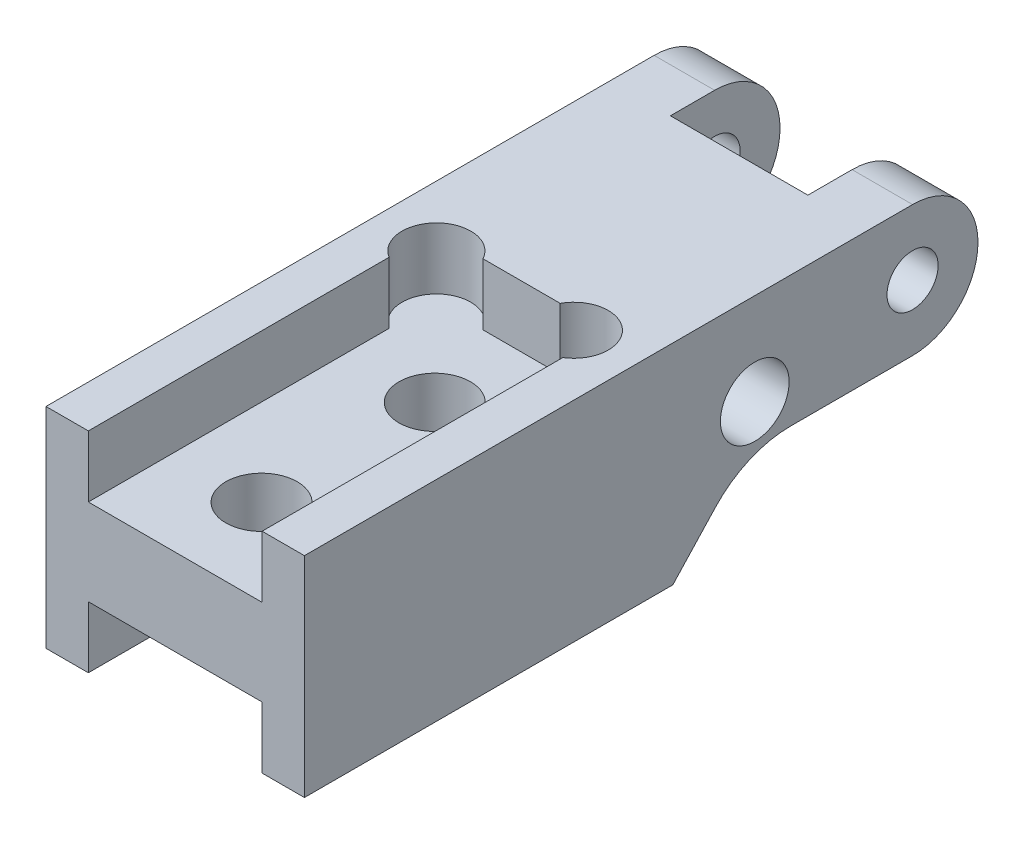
ISO-10303-21;
HEADER;
FILE_DESCRIPTION(('STEP AP214'),'2;1');
FILE_NAME('part.step','',(''),(''),'','','');
FILE_SCHEMA(('AUTOMOTIVE_DESIGN { 1 0 10303 214 1 1 1 1 }'));
ENDSEC;
DATA;
#1=APPLICATION_CONTEXT('core data for automotive mechanical design processes');
#2=APPLICATION_PROTOCOL_DEFINITION('international standard','automotive_design',2000,#1);
#3=PRODUCT_CONTEXT('',#1,'mechanical');
#4=PRODUCT('Part','Part','',(#3));
#5=PRODUCT_RELATED_PRODUCT_CATEGORY('part','',(#4));
#6=PRODUCT_DEFINITION_FORMATION('','',#4);
#7=PRODUCT_DEFINITION_CONTEXT('part definition',#1,'design');
#8=PRODUCT_DEFINITION('design','',#6,#7);
#9=PRODUCT_DEFINITION_SHAPE('','',#8);
#10=(LENGTH_UNIT() NAMED_UNIT(*) SI_UNIT(.MILLI.,.METRE.));
#11=(NAMED_UNIT(*) PLANE_ANGLE_UNIT() SI_UNIT($,.RADIAN.));
#12=(NAMED_UNIT(*) SI_UNIT($,.STERADIAN.) SOLID_ANGLE_UNIT());
#13=UNCERTAINTY_MEASURE_WITH_UNIT(LENGTH_MEASURE(1.E-05),#10,'distance_accuracy_value','');
#14=(GEOMETRIC_REPRESENTATION_CONTEXT(3) GLOBAL_UNCERTAINTY_ASSIGNED_CONTEXT((#13)) GLOBAL_UNIT_ASSIGNED_CONTEXT((#10,
#11,#12)) REPRESENTATION_CONTEXT('',''));
#15=CARTESIAN_POINT('',(0.,0.,0.));
#16=DIRECTION('',(0.,0.,1.));
#17=DIRECTION('',(1.,0.,0.));
#18=AXIS2_PLACEMENT_3D('',#15,#16,#17);
#19=CARTESIAN_POINT('',(-5.96899999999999,4.8387,-15.5575));
#20=DIRECTION('',(0.,1.,0.));
#21=DIRECTION('',(0.,0.,1.));
#22=AXIS2_PLACEMENT_3D('',#19,#20,#21);
#23=PLANE('',#22);
#24=CARTESIAN_POINT('',(-3.175,4.8387,0.317500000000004));
#25=DIRECTION('',(0.,1.,0.));
#26=DIRECTION('',(0.,0.,-1.));
#27=AXIS2_PLACEMENT_3D('',#24,#25,#26);
#28=CIRCLE('',#27,1.5875);
#29=CARTESIAN_POINT('',(-1.78233627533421,4.8387,-0.444499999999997));
#30=VERTEX_POINT('',#29);
#31=CARTESIAN_POINT('',(-4.0132,4.8387,1.66567543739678));
#32=VERTEX_POINT('',#31);
#33=EDGE_CURVE('E462',#30,#32,#28,.T.);
#34=ORIENTED_EDGE('',*,*,#33,.F.);
#35=DIRECTION('',(-1.,0.,0.));
#36=VECTOR('',#35,1.);
#37=CARTESIAN_POINT('',(4.0132,4.8387,-0.444499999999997));
#38=LINE('',#37,#36);
#39=CARTESIAN_POINT('',(1.78233627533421,4.8387,-0.444499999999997));
#40=VERTEX_POINT('',#39);
#41=EDGE_CURVE('E413',#40,#30,#38,.T.);
#42=ORIENTED_EDGE('',*,*,#41,.F.);
#43=CARTESIAN_POINT('',(3.175,4.8387,0.317500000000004));
#44=DIRECTION('',(0.,1.,0.));
#45=DIRECTION('',(0.,0.,1.));
#46=AXIS2_PLACEMENT_3D('',#43,#44,#45);
#47=CIRCLE('',#46,1.5875);
#48=CARTESIAN_POINT('',(4.0132,4.8387,1.66567543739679));
#49=VERTEX_POINT('',#48);
#50=EDGE_CURVE('E410',#49,#40,#47,.T.);
#51=ORIENTED_EDGE('',*,*,#50,.F.);
#52=DIRECTION('',(0.,0.,-1.));
#53=VECTOR('',#52,1.);
#54=CARTESIAN_POINT('',(4.0132,4.8387,15.5575));
#55=LINE('',#54,#53);
#56=CARTESIAN_POINT('',(4.0132,4.8387,15.5575));
#57=VERTEX_POINT('',#56);
#58=EDGE_CURVE('E408',#57,#49,#55,.T.);
#59=ORIENTED_EDGE('',*,*,#58,.F.);
#60=DIRECTION('',(1.,0.,0.));
#61=VECTOR('',#60,1.);
#62=CARTESIAN_POINT('',(-5.969,4.8387,15.5575));
#63=LINE('',#62,#61);
#64=CARTESIAN_POINT('',(5.969,4.8387,15.5575));
#65=VERTEX_POINT('',#64);
#66=EDGE_CURVE('E320',#57,#65,#63,.T.);
#67=ORIENTED_EDGE('',*,*,#66,.T.);
#68=DIRECTION('',(0.,0.,-1.));
#69=VECTOR('',#68,1.);
#70=CARTESIAN_POINT('',(5.969,4.8387,-15.5575));
#71=LINE('',#70,#69);
#72=CARTESIAN_POINT('',(5.969,4.8387,-12.5349));
#73=VERTEX_POINT('',#72);
#74=EDGE_CURVE('E325',#65,#73,#71,.T.);
#75=ORIENTED_EDGE('',*,*,#74,.T.);
#76=DIRECTION('',(-1.,0.,0.));
#77=VECTOR('',#76,1.);
#78=CARTESIAN_POINT('',(-5.96899999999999,4.8387,-12.5349));
#79=LINE('',#78,#77);
#80=CARTESIAN_POINT('',(3.175,4.8387,-12.5349));
#81=VERTEX_POINT('',#80);
#82=EDGE_CURVE('E341',#73,#81,#79,.T.);
#83=ORIENTED_EDGE('',*,*,#82,.T.);
#84=DIRECTION('',(0.,0.,-1.));
#85=VECTOR('',#84,1.);
#86=CARTESIAN_POINT('',(3.175,4.8387,-15.5575));
#87=LINE('',#86,#85);
#88=CARTESIAN_POINT('',(3.175,4.8387,-10.4927289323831));
#89=VERTEX_POINT('',#88);
#90=EDGE_CURVE('E249',#89,#81,#87,.T.);
#91=ORIENTED_EDGE('',*,*,#90,.F.);
#92=DIRECTION('',(1.,0.,0.));
#93=VECTOR('',#92,1.);
#94=CARTESIAN_POINT('',(-5.96899999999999,4.8387,-10.4927289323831));
#95=LINE('',#94,#93);
#96=CARTESIAN_POINT('',(-3.175,4.8387,-10.4927289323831));
#97=VERTEX_POINT('',#96);
#98=EDGE_CURVE('E265',#97,#89,#95,.T.);
#99=ORIENTED_EDGE('',*,*,#98,.F.);
#100=DIRECTION('',(0.,0.,-1.));
#101=VECTOR('',#100,1.);
#102=CARTESIAN_POINT('',(-3.175,4.8387,-15.5575));
#103=LINE('',#102,#101);
#104=CARTESIAN_POINT('',(-3.175,4.8387,-12.5349));
#105=VERTEX_POINT('',#104);
#106=EDGE_CURVE('E260',#97,#105,#103,.T.);
#107=ORIENTED_EDGE('',*,*,#106,.T.);
#108=CARTESIAN_POINT('',(-5.96899999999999,4.8387,-12.5349));
#109=VERTEX_POINT('',#108);
#110=EDGE_CURVE('E340',#105,#109,#79,.T.);
#111=ORIENTED_EDGE('',*,*,#110,.T.);
#112=DIRECTION('',(0.,0.,1.));
#113=VECTOR('',#112,1.);
#114=CARTESIAN_POINT('',(-5.96899999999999,4.8387,-15.5575));
#115=LINE('',#114,#113);
#116=CARTESIAN_POINT('',(-5.969,4.8387,15.5575));
#117=VERTEX_POINT('',#116);
#118=EDGE_CURVE('E318',#109,#117,#115,.T.);
#119=ORIENTED_EDGE('',*,*,#118,.T.);
#120=CARTESIAN_POINT('',(-4.0132,4.8387,15.5575));
#121=VERTEX_POINT('',#120);
#122=EDGE_CURVE('E322',#117,#121,#63,.T.);
#123=ORIENTED_EDGE('',*,*,#122,.T.);
#124=DIRECTION('',(0.,0.,1.));
#125=VECTOR('',#124,1.);
#126=CARTESIAN_POINT('',(-4.0132,4.8387,15.5575));
#127=LINE('',#126,#125);
#128=EDGE_CURVE('E417',#32,#121,#127,.T.);
#129=ORIENTED_EDGE('',*,*,#128,.F.);
#130=EDGE_LOOP('',(#34,#42,#51,#59,#67,#75,#83,#91,#99,#107,#111,#119,#123,#129));
#131=FACE_BOUND('',#130,.T.);
#132=ADVANCED_FACE('F35',(#131),#23,.T.);
#133=CARTESIAN_POINT('',(-5.969,1.8161,-12.5349));
#134=DIRECTION('',(1.,0.,0.));
#135=DIRECTION('',(0.,0.,-1.));
#136=AXIS2_PLACEMENT_3D('',#133,#134,#135);
#137=CYLINDRICAL_SURFACE('',#136,3.0226);
#138=CARTESIAN_POINT('',(-3.175,1.8161,-12.5349));
#139=DIRECTION('',(1.,0.,0.));
#140=DIRECTION('',(0.,0.,-1.));
#141=AXIS2_PLACEMENT_3D('',#138,#139,#140);
#142=CIRCLE('',#141,3.0226);
#143=CARTESIAN_POINT('',(-3.175,-1.20650000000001,-12.5349));
#144=VERTEX_POINT('',#143);
#145=CARTESIAN_POINT('',(-3.175,1.8161,-15.5575));
#146=VERTEX_POINT('',#145);
#147=EDGE_CURVE('E258',#144,#146,#142,.T.);
#148=ORIENTED_EDGE('',*,*,#147,.F.);
#149=DIRECTION('',(1.,0.,0.));
#150=VECTOR('',#149,1.);
#151=CARTESIAN_POINT('',(-5.969,-1.20650000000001,-12.5349));
#152=LINE('',#151,#150);
#153=CARTESIAN_POINT('',(-5.969,-1.20650000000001,-12.5349));
#154=VERTEX_POINT('',#153);
#155=EDGE_CURVE('E315',#154,#144,#152,.T.);
#156=ORIENTED_EDGE('',*,*,#155,.F.);
#157=CARTESIAN_POINT('',(-5.969,1.8161,-12.5349));
#158=DIRECTION('',(-1.,0.,0.));
#159=DIRECTION('',(0.,0.,-1.));
#160=AXIS2_PLACEMENT_3D('',#157,#158,#159);
#161=CIRCLE('',#160,3.0226);
#162=CARTESIAN_POINT('',(-5.969,1.8161,-15.5575));
#163=VERTEX_POINT('',#162);
#164=EDGE_CURVE('E280',#163,#154,#161,.T.);
#165=ORIENTED_EDGE('',*,*,#164,.F.);
#166=DIRECTION('',(1.,0.,0.));
#167=VECTOR('',#166,1.);
#168=CARTESIAN_POINT('',(-5.969,1.8161,-15.5575));
#169=LINE('',#168,#167);
#170=EDGE_CURVE('E303',#163,#146,#169,.T.);
#171=ORIENTED_EDGE('',*,*,#170,.T.);
#172=EDGE_LOOP('',(#148,#156,#165,#171));
#173=FACE_BOUND('',#172,.T.);
#174=ADVANCED_FACE('F377',(#173),#137,.T.);
#175=CARTESIAN_POINT('',(-5.969,-1.20650000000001,-12.5349));
#176=DIRECTION('',(0.,1.,0.));
#177=DIRECTION('',(0.,0.,1.));
#178=AXIS2_PLACEMENT_3D('',#175,#176,#177);
#179=PLANE('',#178);
#180=DIRECTION('',(0.,0.,-1.));
#181=VECTOR('',#180,1.);
#182=CARTESIAN_POINT('',(-3.175,-1.20650000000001,-12.5349));
#183=LINE('',#182,#181);
#184=CARTESIAN_POINT('',(-3.175,-1.20650000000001,-7.00253108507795));
#185=VERTEX_POINT('',#184);
#186=EDGE_CURVE('E263',#185,#144,#183,.T.);
#187=ORIENTED_EDGE('',*,*,#186,.F.);
#188=DIRECTION('',(1.,0.,0.));
#189=VECTOR('',#188,1.);
#190=CARTESIAN_POINT('',(-5.969,-1.20650000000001,-7.00253108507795));
#191=LINE('',#190,#189);
#192=CARTESIAN_POINT('',(3.175,-1.20650000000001,-7.00253108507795));
#193=VERTEX_POINT('',#192);
#194=EDGE_CURVE('E11',#185,#193,#191,.T.);
#195=ORIENTED_EDGE('',*,*,#194,.T.);
#196=DIRECTION('',(0.,0.,-1.));
#197=VECTOR('',#196,1.);
#198=CARTESIAN_POINT('',(3.175,-1.20650000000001,-12.5349));
#199=LINE('',#198,#197);
#200=CARTESIAN_POINT('',(3.175,-1.20650000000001,-12.5349));
#201=VERTEX_POINT('',#200);
#202=EDGE_CURVE('E251',#193,#201,#199,.T.);
#203=ORIENTED_EDGE('',*,*,#202,.T.);
#204=CARTESIAN_POINT('',(5.969,-1.20650000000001,-12.5349));
#205=VERTEX_POINT('',#204);
#206=EDGE_CURVE('E293',#201,#205,#152,.T.);
#207=ORIENTED_EDGE('',*,*,#206,.T.);
#208=DIRECTION('',(0.,0.,1.));
#209=VECTOR('',#208,1.);
#210=CARTESIAN_POINT('',(5.969,-1.20650000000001,-12.5349));
#211=LINE('',#210,#209);
#212=CARTESIAN_POINT('',(5.969,-1.20650000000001,-6.90952915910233));
#213=VERTEX_POINT('',#212);
#214=EDGE_CURVE('E296',#205,#213,#211,.T.);
#215=ORIENTED_EDGE('',*,*,#214,.T.);
#216=DIRECTION('',(1.,0.,0.));
#217=VECTOR('',#216,1.);
#218=CARTESIAN_POINT('',(-5.969,-1.20650000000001,-6.90952915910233));
#219=LINE('',#218,#217);
#220=CARTESIAN_POINT('',(-5.969,-1.20650000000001,-6.90952915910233));
#221=VERTEX_POINT('',#220);
#222=EDGE_CURVE('E313',#221,#213,#219,.T.);
#223=ORIENTED_EDGE('',*,*,#222,.F.);
#224=DIRECTION('',(0.,0.,1.));
#225=VECTOR('',#224,1.);
#226=CARTESIAN_POINT('',(-5.969,-1.20650000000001,-12.5349));
#227=LINE('',#226,#225);
#228=EDGE_CURVE('E283',#154,#221,#227,.T.);
#229=ORIENTED_EDGE('',*,*,#228,.F.);
#230=ORIENTED_EDGE('',*,*,#155,.T.);
#231=EDGE_LOOP('',(#187,#195,#203,#207,#215,#223,#229,#230));
#232=FACE_BOUND('',#231,.T.);
#233=ADVANCED_FACE('F368',(#232),#179,.F.);
#234=CARTESIAN_POINT('',(-5.96899999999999,1.8161,-12.5349));
#235=DIRECTION('',(1.,0.,0.));
#236=DIRECTION('',(0.,0.,-1.));
#237=AXIS2_PLACEMENT_3D('',#234,#235,#236);
#238=CYLINDRICAL_SURFACE('',#237,3.0226);
#239=ORIENTED_EDGE('',*,*,#110,.F.);
#240=CARTESIAN_POINT('',(-3.175,1.8161,-12.5349));
#241=DIRECTION('',(1.,0.,0.));
#242=DIRECTION('',(0.,0.,-1.));
#243=AXIS2_PLACEMENT_3D('',#240,#241,#242);
#244=CIRCLE('',#243,3.0226);
#245=EDGE_CURVE('E255',#105,#146,#244,.F.);
#246=ORIENTED_EDGE('',*,*,#245,.T.);
#247=ORIENTED_EDGE('',*,*,#170,.F.);
#248=CARTESIAN_POINT('',(-5.96899999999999,1.8161,-12.5349));
#249=DIRECTION('',(1.,0.,0.));
#250=DIRECTION('',(0.,0.,-1.));
#251=AXIS2_PLACEMENT_3D('',#248,#249,#250);
#252=CIRCLE('',#251,3.0226);
#253=EDGE_CURVE('E344',#109,#163,#252,.F.);
#254=ORIENTED_EDGE('',*,*,#253,.F.);
#255=EDGE_LOOP('',(#239,#246,#247,#254));
#256=FACE_BOUND('',#255,.T.);
#257=ADVANCED_FACE('F358',(#256),#238,.T.);
#258=CARTESIAN_POINT('',(-5.969,1.8161,-12.5349));
#259=DIRECTION('',(1.,0.,0.));
#260=DIRECTION('',(0.,0.,-1.));
#261=AXIS2_PLACEMENT_3D('',#258,#259,#260);
#262=CYLINDRICAL_SURFACE('',#261,1.1811);
#263=CARTESIAN_POINT('',(-5.969,1.8161,-12.5349));
#264=DIRECTION('',(1.,0.,0.));
#265=DIRECTION('',(0.,0.,-1.));
#266=AXIS2_PLACEMENT_3D('',#263,#264,#265);
#267=CIRCLE('',#266,1.1811);
#268=CARTESIAN_POINT('',(-5.969,1.8161,-13.716));
#269=VERTEX_POINT('',#268);
#270=EDGE_CURVE('E274',#269,#269,#267,.T.);
#271=ORIENTED_EDGE('',*,*,#270,.F.);
#272=EDGE_LOOP('',(#271));
#273=FACE_BOUND('',#272,.T.);
#274=CARTESIAN_POINT('',(-3.175,1.8161,-12.5349));
#275=DIRECTION('',(1.,0.,0.));
#276=DIRECTION('',(0.,0.,-1.));
#277=AXIS2_PLACEMENT_3D('',#274,#275,#276);
#278=CIRCLE('',#277,1.1811);
#279=CARTESIAN_POINT('',(-3.175,1.8161,-13.716));
#280=VERTEX_POINT('',#279);
#281=EDGE_CURVE('E254',#280,#280,#278,.F.);
#282=ORIENTED_EDGE('',*,*,#281,.F.);
#283=EDGE_LOOP('',(#282));
#284=FACE_BOUND('',#283,.T.);
#285=ADVANCED_FACE('F355',(#273,#284),#262,.F.);
#286=CARTESIAN_POINT('',(-5.96899999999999,4.8387,-15.5575));
#287=DIRECTION('',(1.,0.,0.));
#288=DIRECTION('',(0.,0.,-1.));
#289=AXIS2_PLACEMENT_3D('',#286,#287,#288);
#290=PLANE('',#289);
#291=CARTESIAN_POINT('',(-5.96900000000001,0.596899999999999,-5.24509999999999));
#292=DIRECTION('',(1.,0.,0.));
#293=DIRECTION('',(0.,0.,-1.));
#294=AXIS2_PLACEMENT_3D('',#291,#292,#293);
#295=CIRCLE('',#294,1.5875);
#296=CARTESIAN_POINT('',(-5.96900000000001,0.596899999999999,-6.83259999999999));
#297=VERTEX_POINT('',#296);
#298=EDGE_CURVE('E268',#297,#297,#295,.T.);
#299=ORIENTED_EDGE('',*,*,#298,.T.);
#300=EDGE_LOOP('',(#299));
#301=FACE_BOUND('',#300,.T.);
#302=ORIENTED_EDGE('',*,*,#270,.T.);
#303=EDGE_LOOP('',(#302));
#304=FACE_BOUND('',#303,.T.);
#305=ORIENTED_EDGE('',*,*,#118,.F.);
#306=ORIENTED_EDGE('',*,*,#253,.T.);
#307=ORIENTED_EDGE('',*,*,#164,.T.);
#308=ORIENTED_EDGE('',*,*,#228,.T.);
#309=CARTESIAN_POINT('',(-5.969,-5.96900000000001,-6.90952915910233));
#310=DIRECTION('',(1.,0.,0.));
#311=DIRECTION('',(0.,0.,-1.));
#312=AXIS2_PLACEMENT_3D('',#309,#310,#311);
#313=CIRCLE('',#312,4.7625);
#314=CARTESIAN_POINT('',(-5.969,-2.72880380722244,-3.41918033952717));
#315=VERTEX_POINT('',#314);
#316=EDGE_CURVE('E287',#221,#315,#313,.T.);
#317=ORIENTED_EDGE('',*,*,#316,.T.);
#318=DIRECTION('',(0.,-0.732881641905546,0.680356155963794));
#319=VECTOR('',#318,1.);
#320=CARTESIAN_POINT('',(-5.969,-4.8387,-1.4605));
#321=LINE('',#320,#319);
#322=CARTESIAN_POINT('',(-5.969,-4.8387,-1.4605));
#323=VERTEX_POINT('',#322);
#324=EDGE_CURVE('E290',#315,#323,#321,.T.);
#325=ORIENTED_EDGE('',*,*,#324,.T.);
#326=DIRECTION('',(0.,0.,1.));
#327=VECTOR('',#326,1.);
#328=CARTESIAN_POINT('',(-5.96899999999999,-4.8387,-15.5575));
#329=LINE('',#328,#327);
#330=CARTESIAN_POINT('',(-5.969,-4.8387,15.5575));
#331=VERTEX_POINT('',#330);
#332=EDGE_CURVE('E306',#323,#331,#329,.T.);
#333=ORIENTED_EDGE('',*,*,#332,.T.);
#334=DIRECTION('',(0.,-1.,0.));
#335=VECTOR('',#334,1.);
#336=CARTESIAN_POINT('',(-5.969,4.8387,15.5575));
#337=LINE('',#336,#335);
#338=EDGE_CURVE('E337',#117,#331,#337,.T.);
#339=ORIENTED_EDGE('',*,*,#338,.F.);
#340=EDGE_LOOP('',(#305,#306,#307,#308,#317,#325,#333,#339));
#341=FACE_BOUND('',#340,.T.);
#342=ADVANCED_FACE('F357',(#301,#304,#341),#290,.F.);
#343=CARTESIAN_POINT('',(-5.969,4.8387,15.5575));
#344=DIRECTION('',(0.,0.,-1.));
#345=DIRECTION('',(-1.,0.,0.));
#346=AXIS2_PLACEMENT_3D('',#343,#344,#345);
#347=PLANE('',#346);
#348=ORIENTED_EDGE('',*,*,#66,.F.);
#349=DIRECTION('',(0.,1.,0.));
#350=VECTOR('',#349,1.);
#351=CARTESIAN_POINT('',(4.0132,1.9939,15.5575));
#352=LINE('',#351,#350);
#353=CARTESIAN_POINT('',(4.0132,1.9939,15.5575));
#354=VERTEX_POINT('',#353);
#355=EDGE_CURVE('E229',#354,#57,#352,.T.);
#356=ORIENTED_EDGE('',*,*,#355,.F.);
#357=DIRECTION('',(1.,0.,0.));
#358=VECTOR('',#357,1.);
#359=CARTESIAN_POINT('',(4.0132,1.9939,15.5575));
#360=LINE('',#359,#358);
#361=CARTESIAN_POINT('',(-4.0132,1.9939,15.5575));
#362=VERTEX_POINT('',#361);
#363=EDGE_CURVE('E422',#362,#354,#360,.T.);
#364=ORIENTED_EDGE('',*,*,#363,.F.);
#365=DIRECTION('',(0.,1.,0.));
#366=VECTOR('',#365,1.);
#367=CARTESIAN_POINT('',(-4.0132,1.9939,15.5575));
#368=LINE('',#367,#366);
#369=EDGE_CURVE('E428',#362,#121,#368,.T.);
#370=ORIENTED_EDGE('',*,*,#369,.T.);
#371=ORIENTED_EDGE('',*,*,#122,.F.);
#372=ORIENTED_EDGE('',*,*,#338,.T.);
#373=DIRECTION('',(1.,0.,0.));
#374=VECTOR('',#373,1.);
#375=CARTESIAN_POINT('',(-5.969,-4.8387,15.5575));
#376=LINE('',#375,#374);
#377=CARTESIAN_POINT('',(-4.0132,-4.8387,15.5575));
#378=VERTEX_POINT('',#377);
#379=EDGE_CURVE('E331',#331,#378,#376,.T.);
#380=ORIENTED_EDGE('',*,*,#379,.T.);
#381=DIRECTION('',(0.,-1.,0.));
#382=VECTOR('',#381,1.);
#383=CARTESIAN_POINT('',(-4.0132,-1.9939,15.5575));
#384=LINE('',#383,#382);
#385=CARTESIAN_POINT('',(-4.0132,-1.9939,15.5575));
#386=VERTEX_POINT('',#385);
#387=EDGE_CURVE('E224',#386,#378,#384,.T.);
#388=ORIENTED_EDGE('',*,*,#387,.F.);
#389=DIRECTION('',(-1.,0.,0.));
#390=VECTOR('',#389,1.);
#391=CARTESIAN_POINT('',(4.0132,-1.9939,15.5575));
#392=LINE('',#391,#390);
#393=CARTESIAN_POINT('',(4.0132,-1.9939,15.5575));
#394=VERTEX_POINT('',#393);
#395=EDGE_CURVE('E432',#394,#386,#392,.T.);
#396=ORIENTED_EDGE('',*,*,#395,.F.);
#397=DIRECTION('',(0.,-1.,0.));
#398=VECTOR('',#397,1.);
#399=CARTESIAN_POINT('',(4.0132,-1.9939,15.5575));
#400=LINE('',#399,#398);
#401=CARTESIAN_POINT('',(4.0132,-4.8387,15.5575));
#402=VERTEX_POINT('',#401);
#403=EDGE_CURVE('E235',#394,#402,#400,.T.);
#404=ORIENTED_EDGE('',*,*,#403,.T.);
#405=CARTESIAN_POINT('',(5.969,-4.8387,15.5575));
#406=VERTEX_POINT('',#405);
#407=EDGE_CURVE('E330',#402,#406,#376,.T.);
#408=ORIENTED_EDGE('',*,*,#407,.T.);
#409=DIRECTION('',(0.,-1.,0.));
#410=VECTOR('',#409,1.);
#411=CARTESIAN_POINT('',(5.969,4.8387,15.5575));
#412=LINE('',#411,#410);
#413=EDGE_CURVE('E328',#65,#406,#412,.T.);
#414=ORIENTED_EDGE('',*,*,#413,.F.);
#415=EDGE_LOOP('',(#348,#356,#364,#370,#371,#372,#380,#388,#396,#404,#408,#414));
#416=FACE_BOUND('',#415,.T.);
#417=ADVANCED_FACE('F366',(#416),#347,.F.);
#418=CARTESIAN_POINT('',(5.969,4.8387,-15.5575));
#419=DIRECTION('',(-1.,0.,0.));
#420=DIRECTION('',(0.,0.,1.));
#421=AXIS2_PLACEMENT_3D('',#418,#419,#420);
#422=PLANE('',#421);
#423=CARTESIAN_POINT('',(5.969,0.596899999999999,-5.24509999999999));
#424=DIRECTION('',(1.,0.,0.));
#425=DIRECTION('',(0.,0.,-1.));
#426=AXIS2_PLACEMENT_3D('',#423,#424,#425);
#427=CIRCLE('',#426,1.5875);
#428=CARTESIAN_POINT('',(5.969,0.596899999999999,-6.83259999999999));
#429=VERTEX_POINT('',#428);
#430=EDGE_CURVE('E267',#429,#429,#427,.T.);
#431=ORIENTED_EDGE('',*,*,#430,.F.);
#432=EDGE_LOOP('',(#431));
#433=FACE_BOUND('',#432,.T.);
#434=CARTESIAN_POINT('',(5.969,1.8161,-12.5349));
#435=DIRECTION('',(1.,0.,0.));
#436=DIRECTION('',(0.,0.,-1.));
#437=AXIS2_PLACEMENT_3D('',#434,#435,#436);
#438=CIRCLE('',#437,1.1811);
#439=CARTESIAN_POINT('',(5.969,1.8161,-13.716));
#440=VERTEX_POINT('',#439);
#441=EDGE_CURVE('E271',#440,#440,#438,.T.);
#442=ORIENTED_EDGE('',*,*,#441,.F.);
#443=EDGE_LOOP('',(#442));
#444=FACE_BOUND('',#443,.T.);
#445=CARTESIAN_POINT('',(5.969,1.8161,-12.5349));
#446=DIRECTION('',(-1.,0.,0.));
#447=DIRECTION('',(0.,0.,-1.));
#448=AXIS2_PLACEMENT_3D('',#445,#446,#447);
#449=CIRCLE('',#448,3.0226);
#450=CARTESIAN_POINT('',(5.969,1.8161,-15.5575));
#451=VERTEX_POINT('',#450);
#452=EDGE_CURVE('E277',#451,#205,#449,.T.);
#453=ORIENTED_EDGE('',*,*,#452,.F.);
#454=CARTESIAN_POINT('',(5.969,1.8161,-12.5349));
#455=DIRECTION('',(-1.,0.,0.));
#456=DIRECTION('',(0.,0.,1.));
#457=AXIS2_PLACEMENT_3D('',#454,#455,#456);
#458=CIRCLE('',#457,3.0226);
#459=EDGE_CURVE('E44',#451,#73,#458,.F.);
#460=ORIENTED_EDGE('',*,*,#459,.T.);
#461=ORIENTED_EDGE('',*,*,#74,.F.);
#462=ORIENTED_EDGE('',*,*,#413,.T.);
#463=DIRECTION('',(0.,0.,-1.));
#464=VECTOR('',#463,1.);
#465=CARTESIAN_POINT('',(5.969,-4.8387,-15.5575));
#466=LINE('',#465,#464);
#467=CARTESIAN_POINT('',(5.969,-4.8387,-1.4605));
#468=VERTEX_POINT('',#467);
#469=EDGE_CURVE('E321',#406,#468,#466,.T.);
#470=ORIENTED_EDGE('',*,*,#469,.T.);
#471=DIRECTION('',(0.,-0.732881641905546,0.680356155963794));
#472=VECTOR('',#471,1.);
#473=CARTESIAN_POINT('',(5.969,-4.8387,-1.4605));
#474=LINE('',#473,#472);
#475=CARTESIAN_POINT('',(5.969,-2.72880380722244,-3.41918033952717));
#476=VERTEX_POINT('',#475);
#477=EDGE_CURVE('E284',#476,#468,#474,.T.);
#478=ORIENTED_EDGE('',*,*,#477,.F.);
#479=CARTESIAN_POINT('',(5.969,-5.96900000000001,-6.90952915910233));
#480=DIRECTION('',(1.,0.,0.));
#481=DIRECTION('',(0.,0.,-1.));
#482=AXIS2_PLACEMENT_3D('',#479,#480,#481);
#483=CIRCLE('',#482,4.7625);
#484=EDGE_CURVE('E299',#213,#476,#483,.T.);
#485=ORIENTED_EDGE('',*,*,#484,.F.);
#486=ORIENTED_EDGE('',*,*,#214,.F.);
#487=EDGE_LOOP('',(#453,#460,#461,#462,#470,#478,#485,#486));
#488=FACE_BOUND('',#487,.T.);
#489=ADVANCED_FACE('F391',(#433,#444,#488),#422,.F.);
#490=CARTESIAN_POINT('',(-5.96899999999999,-4.8387,-15.5575));
#491=DIRECTION('',(0.,1.,0.));
#492=DIRECTION('',(0.,0.,1.));
#493=AXIS2_PLACEMENT_3D('',#490,#491,#492);
#494=PLANE('',#493);
#495=DIRECTION('',(1.,0.,0.));
#496=VECTOR('',#495,1.);
#497=CARTESIAN_POINT('',(4.0132,-4.8387,-0.444499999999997));
#498=LINE('',#497,#496);
#499=CARTESIAN_POINT('',(-1.78233627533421,-4.8387,-0.444499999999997));
#500=VERTEX_POINT('',#499);
#501=CARTESIAN_POINT('',(1.78233627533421,-4.8387,-0.444499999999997));
#502=VERTEX_POINT('',#501);
#503=EDGE_CURVE('E219',#500,#502,#498,.T.);
#504=ORIENTED_EDGE('',*,*,#503,.F.);
#505=CARTESIAN_POINT('',(-3.175,-4.8387,0.317500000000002));
#506=DIRECTION('',(0.,-1.,0.));
#507=DIRECTION('',(0.,0.,1.));
#508=AXIS2_PLACEMENT_3D('',#505,#506,#507);
#509=CIRCLE('',#508,1.5875);
#510=CARTESIAN_POINT('',(-4.0132,-4.8387,1.66567543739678));
#511=VERTEX_POINT('',#510);
#512=EDGE_CURVE('E204',#511,#500,#509,.T.);
#513=ORIENTED_EDGE('',*,*,#512,.F.);
#514=DIRECTION('',(0.,0.,-1.));
#515=VECTOR('',#514,1.);
#516=CARTESIAN_POINT('',(-4.0132,-4.8387,15.5575));
#517=LINE('',#516,#515);
#518=EDGE_CURVE('E216',#378,#511,#517,.T.);
#519=ORIENTED_EDGE('',*,*,#518,.F.);
#520=ORIENTED_EDGE('',*,*,#379,.F.);
#521=ORIENTED_EDGE('',*,*,#332,.F.);
#522=DIRECTION('',(1.,0.,0.));
#523=VECTOR('',#522,1.);
#524=CARTESIAN_POINT('',(-5.969,-4.8387,-1.4605));
#525=LINE('',#524,#523);
#526=EDGE_CURVE('E308',#323,#468,#525,.T.);
#527=ORIENTED_EDGE('',*,*,#526,.T.);
#528=ORIENTED_EDGE('',*,*,#469,.F.);
#529=ORIENTED_EDGE('',*,*,#407,.F.);
#530=DIRECTION('',(0.,0.,1.));
#531=VECTOR('',#530,1.);
#532=CARTESIAN_POINT('',(4.0132,-4.8387,15.5575));
#533=LINE('',#532,#531);
#534=CARTESIAN_POINT('',(4.0132,-4.8387,1.66567543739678));
#535=VERTEX_POINT('',#534);
#536=EDGE_CURVE('E225',#535,#402,#533,.T.);
#537=ORIENTED_EDGE('',*,*,#536,.F.);
#538=CARTESIAN_POINT('',(3.175,-4.8387,0.317500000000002));
#539=DIRECTION('',(0.,-1.,0.));
#540=DIRECTION('',(0.,0.,-1.));
#541=AXIS2_PLACEMENT_3D('',#538,#539,#540);
#542=CIRCLE('',#541,1.5875);
#543=EDGE_CURVE('E797',#502,#535,#542,.T.);
#544=ORIENTED_EDGE('',*,*,#543,.F.);
#545=EDGE_LOOP('',(#504,#513,#519,#520,#521,#527,#528,#529,#537,#544));
#546=FACE_BOUND('',#545,.T.);
#547=ADVANCED_FACE('F214',(#546),#494,.F.);
#548=ORIENTED_EDGE('',*,*,#206,.F.);
#549=CARTESIAN_POINT('',(3.175,1.8161,-12.5349));
#550=DIRECTION('',(1.,0.,0.));
#551=DIRECTION('',(0.,0.,-1.));
#552=AXIS2_PLACEMENT_3D('',#549,#550,#551);
#553=CIRCLE('',#552,3.0226);
#554=CARTESIAN_POINT('',(3.175,1.8161,-15.5575));
#555=VERTEX_POINT('',#554);
#556=EDGE_CURVE('E246',#201,#555,#553,.T.);
#557=ORIENTED_EDGE('',*,*,#556,.T.);
#558=EDGE_CURVE('E307',#555,#451,#169,.T.);
#559=ORIENTED_EDGE('',*,*,#558,.T.);
#560=ORIENTED_EDGE('',*,*,#452,.T.);
#561=EDGE_LOOP('',(#548,#557,#559,#560));
#562=FACE_BOUND('',#561,.T.);
#563=ADVANCED_FACE('F385',(#562),#137,.T.);
#564=CARTESIAN_POINT('',(-5.969,-4.8387,-1.4605));
#565=DIRECTION('',(0.,0.680356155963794,0.732881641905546));
#566=DIRECTION('',(0.,-0.732881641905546,0.680356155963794));
#567=AXIS2_PLACEMENT_3D('',#564,#565,#566);
#568=PLANE('',#567);
#569=ORIENTED_EDGE('',*,*,#477,.T.);
#570=ORIENTED_EDGE('',*,*,#526,.F.);
#571=ORIENTED_EDGE('',*,*,#324,.F.);
#572=DIRECTION('',(1.,0.,0.));
#573=VECTOR('',#572,1.);
#574=CARTESIAN_POINT('',(-5.969,-2.72880380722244,-3.41918033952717));
#575=LINE('',#574,#573);
#576=EDGE_CURVE('E311',#315,#476,#575,.T.);
#577=ORIENTED_EDGE('',*,*,#576,.T.);
#578=EDGE_LOOP('',(#569,#570,#571,#577));
#579=FACE_BOUND('',#578,.T.);
#580=ADVANCED_FACE('F449',(#579),#568,.F.);
#581=CARTESIAN_POINT('',(-5.969,-5.96900000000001,-6.90952915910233));
#582=DIRECTION('',(1.,0.,0.));
#583=DIRECTION('',(0.,0.,-1.));
#584=AXIS2_PLACEMENT_3D('',#581,#582,#583);
#585=CYLINDRICAL_SURFACE('',#584,4.7625);
#586=ORIENTED_EDGE('',*,*,#484,.T.);
#587=ORIENTED_EDGE('',*,*,#576,.F.);
#588=ORIENTED_EDGE('',*,*,#316,.F.);
#589=ORIENTED_EDGE('',*,*,#222,.T.);
#590=EDGE_LOOP('',(#586,#587,#588,#589));
#591=FACE_BOUND('',#590,.T.);
#592=ADVANCED_FACE('F519',(#591),#585,.F.);
#593=CARTESIAN_POINT('',(3.175,1.8161,-12.5349));
#594=DIRECTION('',(1.,0.,0.));
#595=DIRECTION('',(0.,0.,-1.));
#596=AXIS2_PLACEMENT_3D('',#593,#594,#595);
#597=CIRCLE('',#596,3.0226);
#598=EDGE_CURVE('E244',#81,#555,#597,.F.);
#599=ORIENTED_EDGE('',*,*,#598,.F.);
#600=ORIENTED_EDGE('',*,*,#82,.F.);
#601=ORIENTED_EDGE('',*,*,#459,.F.);
#602=ORIENTED_EDGE('',*,*,#558,.F.);
#603=EDGE_LOOP('',(#599,#600,#601,#602));
#604=FACE_BOUND('',#603,.T.);
#605=ADVANCED_FACE('F37',(#604),#238,.T.);
#606=CARTESIAN_POINT('',(3.175,1.8161,-12.5349));
#607=DIRECTION('',(1.,0.,0.));
#608=DIRECTION('',(0.,0.,-1.));
#609=AXIS2_PLACEMENT_3D('',#606,#607,#608);
#610=CIRCLE('',#609,1.1811);
#611=CARTESIAN_POINT('',(3.175,1.8161,-13.716));
#612=VERTEX_POINT('',#611);
#613=EDGE_CURVE('E241',#612,#612,#610,.F.);
#614=ORIENTED_EDGE('',*,*,#613,.T.);
#615=EDGE_LOOP('',(#614));
#616=FACE_BOUND('',#615,.T.);
#617=ORIENTED_EDGE('',*,*,#441,.T.);
#618=EDGE_LOOP('',(#617));
#619=FACE_BOUND('',#618,.T.);
#620=ADVANCED_FACE('F361',(#616,#619),#262,.F.);
#621=CARTESIAN_POINT('',(-5.96900000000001,0.596899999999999,-5.24509999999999));
#622=DIRECTION('',(1.,0.,0.));
#623=DIRECTION('',(0.,0.,-1.));
#624=AXIS2_PLACEMENT_3D('',#621,#622,#623);
#625=CYLINDRICAL_SURFACE('',#624,1.5875);
#626=ORIENTED_EDGE('',*,*,#298,.F.);
#627=EDGE_LOOP('',(#626));
#628=FACE_BOUND('',#627,.T.);
#629=ORIENTED_EDGE('',*,*,#430,.T.);
#630=EDGE_LOOP('',(#629));
#631=FACE_BOUND('',#630,.T.);
#632=ADVANCED_FACE('F374',(#628,#631),#625,.F.);
#633=CARTESIAN_POINT('',(-3.175,-3.65124999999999,-5.59105401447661));
#634=DIRECTION('',(0.,0.500000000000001,0.866025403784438));
#635=DIRECTION('',(0.,-0.866025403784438,0.500000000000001));
#636=AXIS2_PLACEMENT_3D('',#633,#634,#635);
#637=PLANE('',#636);
#638=ORIENTED_EDGE('',*,*,#98,.T.);
#639=DIRECTION('',(0.,-0.866025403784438,0.500000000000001));
#640=VECTOR('',#639,1.);
#641=CARTESIAN_POINT('',(3.175,-3.65124999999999,-5.59105401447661));
#642=LINE('',#641,#640);
#643=EDGE_CURVE('E234',#89,#193,#642,.T.);
#644=ORIENTED_EDGE('',*,*,#643,.T.);
#645=ORIENTED_EDGE('',*,*,#194,.F.);
#646=DIRECTION('',(0.,-0.866025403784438,0.500000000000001));
#647=VECTOR('',#646,1.);
#648=CARTESIAN_POINT('',(-3.175,-3.65124999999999,-5.59105401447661));
#649=LINE('',#648,#647);
#650=EDGE_CURVE('E238',#97,#185,#649,.T.);
#651=ORIENTED_EDGE('',*,*,#650,.F.);
#652=EDGE_LOOP('',(#638,#644,#645,#651));
#653=FACE_BOUND('',#652,.T.);
#654=ADVANCED_FACE('F508',(#653),#637,.F.);
#655=CARTESIAN_POINT('',(-3.175,-6.0325,-9.7155));
#656=DIRECTION('',(1.,0.,0.));
#657=DIRECTION('',(0.,0.,-1.));
#658=AXIS2_PLACEMENT_3D('',#655,#656,#657);
#659=PLANE('',#658);
#660=ORIENTED_EDGE('',*,*,#281,.T.);
#661=EDGE_LOOP('',(#660));
#662=FACE_BOUND('',#661,.T.);
#663=ORIENTED_EDGE('',*,*,#186,.T.);
#664=ORIENTED_EDGE('',*,*,#147,.T.);
#665=ORIENTED_EDGE('',*,*,#245,.F.);
#666=ORIENTED_EDGE('',*,*,#106,.F.);
#667=ORIENTED_EDGE('',*,*,#650,.T.);
#668=EDGE_LOOP('',(#663,#664,#665,#666,#667));
#669=FACE_BOUND('',#668,.T.);
#670=ADVANCED_FACE('F352',(#662,#669),#659,.T.);
#671=CARTESIAN_POINT('',(3.175,-6.0325,-9.7155));
#672=DIRECTION('',(1.,0.,0.));
#673=DIRECTION('',(0.,0.,-1.));
#674=AXIS2_PLACEMENT_3D('',#671,#672,#673);
#675=PLANE('',#674);
#676=ORIENTED_EDGE('',*,*,#613,.F.);
#677=EDGE_LOOP('',(#676));
#678=FACE_BOUND('',#677,.T.);
#679=ORIENTED_EDGE('',*,*,#643,.F.);
#680=ORIENTED_EDGE('',*,*,#90,.T.);
#681=ORIENTED_EDGE('',*,*,#598,.T.);
#682=ORIENTED_EDGE('',*,*,#556,.F.);
#683=ORIENTED_EDGE('',*,*,#202,.F.);
#684=EDGE_LOOP('',(#679,#680,#681,#682,#683));
#685=FACE_BOUND('',#684,.T.);
#686=ADVANCED_FACE('F510',(#678,#685),#675,.F.);
#687=CARTESIAN_POINT('',(4.0132,-1.9939,15.5575));
#688=DIRECTION('',(1.,0.,0.));
#689=DIRECTION('',(0.,0.,-1.));
#690=AXIS2_PLACEMENT_3D('',#687,#688,#689);
#691=PLANE('',#690);
#692=DIRECTION('',(0.,0.,1.));
#693=VECTOR('',#692,1.);
#694=CARTESIAN_POINT('',(4.0132,-1.9939,15.5575));
#695=LINE('',#694,#693);
#696=CARTESIAN_POINT('',(4.0132,-1.9939,1.66567543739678));
#697=VERTEX_POINT('',#696);
#698=EDGE_CURVE('E227',#697,#394,#695,.T.);
#699=ORIENTED_EDGE('',*,*,#698,.F.);
#700=DIRECTION('',(0.,-1.,0.));
#701=VECTOR('',#700,1.);
#702=CARTESIAN_POINT('',(4.0132,2.49622806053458,1.66567543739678));
#703=LINE('',#702,#701);
#704=EDGE_CURVE('E460',#697,#535,#703,.T.);
#705=ORIENTED_EDGE('',*,*,#704,.T.);
#706=ORIENTED_EDGE('',*,*,#536,.T.);
#707=ORIENTED_EDGE('',*,*,#403,.F.);
#708=EDGE_LOOP('',(#699,#705,#706,#707));
#709=FACE_BOUND('',#708,.T.);
#710=ADVANCED_FACE('F458',(#709),#691,.F.);
#711=CARTESIAN_POINT('',(4.0132,-1.9939,-0.444499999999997));
#712=DIRECTION('',(0.,0.,-1.));
#713=DIRECTION('',(-1.,0.,0.));
#714=AXIS2_PLACEMENT_3D('',#711,#712,#713);
#715=PLANE('',#714);
#716=DIRECTION('',(1.,0.,0.));
#717=VECTOR('',#716,1.);
#718=CARTESIAN_POINT('',(4.0132,-1.9939,-0.444499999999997));
#719=LINE('',#718,#717);
#720=CARTESIAN_POINT('',(-1.78233627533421,-1.9939,-0.444499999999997));
#721=VERTEX_POINT('',#720);
#722=CARTESIAN_POINT('',(1.78233627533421,-1.9939,-0.444499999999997));
#723=VERTEX_POINT('',#722);
#724=EDGE_CURVE('E58',#721,#723,#719,.T.);
#725=ORIENTED_EDGE('',*,*,#724,.F.);
#726=DIRECTION('',(0.,-1.,0.));
#727=VECTOR('',#726,1.);
#728=CARTESIAN_POINT('',(-1.78233627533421,2.49622806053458,-0.444499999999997));
#729=LINE('',#728,#727);
#730=EDGE_CURVE('E209',#721,#500,#729,.T.);
#731=ORIENTED_EDGE('',*,*,#730,.T.);
#732=ORIENTED_EDGE('',*,*,#503,.T.);
#733=DIRECTION('',(0.,-1.,0.));
#734=VECTOR('',#733,1.);
#735=CARTESIAN_POINT('',(1.78233627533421,2.49622806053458,-0.444499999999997));
#736=LINE('',#735,#734);
#737=EDGE_CURVE('E463',#502,#723,#736,.F.);
#738=ORIENTED_EDGE('',*,*,#737,.T.);
#739=EDGE_LOOP('',(#725,#731,#732,#738));
#740=FACE_BOUND('',#739,.T.);
#741=ADVANCED_FACE('F670',(#740),#715,.F.);
#742=CARTESIAN_POINT('',(-4.0132,-1.9939,15.5575));
#743=DIRECTION('',(-1.,0.,0.));
#744=DIRECTION('',(0.,0.,1.));
#745=AXIS2_PLACEMENT_3D('',#742,#743,#744);
#746=PLANE('',#745);
#747=ORIENTED_EDGE('',*,*,#518,.T.);
#748=DIRECTION('',(0.,-1.,0.));
#749=VECTOR('',#748,1.);
#750=CARTESIAN_POINT('',(-4.0132,2.49622806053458,1.66567543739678));
#751=LINE('',#750,#749);
#752=CARTESIAN_POINT('',(-4.0132,-1.9939,1.66567543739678));
#753=VERTEX_POINT('',#752);
#754=EDGE_CURVE('E201',#511,#753,#751,.F.);
#755=ORIENTED_EDGE('',*,*,#754,.T.);
#756=DIRECTION('',(0.,0.,-1.));
#757=VECTOR('',#756,1.);
#758=CARTESIAN_POINT('',(-4.0132,-1.9939,15.5575));
#759=LINE('',#758,#757);
#760=EDGE_CURVE('E435',#386,#753,#759,.T.);
#761=ORIENTED_EDGE('',*,*,#760,.F.);
#762=ORIENTED_EDGE('',*,*,#387,.T.);
#763=EDGE_LOOP('',(#747,#755,#761,#762));
#764=FACE_BOUND('',#763,.T.);
#765=ADVANCED_FACE('F222',(#764),#746,.F.);
#766=CARTESIAN_POINT('',(4.0132,-1.9939,-0.444499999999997));
#767=DIRECTION('',(0.,1.,0.));
#768=DIRECTION('',(0.,0.,1.));
#769=AXIS2_PLACEMENT_3D('',#766,#767,#768);
#770=PLANE('',#769);
#771=CARTESIAN_POINT('',(0.,-1.9939,3.5687));
#772=DIRECTION('',(0.,-1.,0.));
#773=DIRECTION('',(0.,0.,-1.));
#774=AXIS2_PLACEMENT_3D('',#771,#772,#773);
#775=CIRCLE('',#774,1.65);
#776=CARTESIAN_POINT('',(0.,-1.9939,1.9187));
#777=VERTEX_POINT('',#776);
#778=EDGE_CURVE('E787',#777,#777,#775,.T.);
#779=ORIENTED_EDGE('',*,*,#778,.F.);
#780=EDGE_LOOP('',(#779));
#781=FACE_BOUND('',#780,.T.);
#782=CARTESIAN_POINT('',(0.,-1.9939,11.5697));
#783=DIRECTION('',(0.,-1.,0.));
#784=DIRECTION('',(0.,0.,-1.));
#785=AXIS2_PLACEMENT_3D('',#782,#783,#784);
#786=CIRCLE('',#785,1.65);
#787=CARTESIAN_POINT('',(0.,-1.9939,9.9197));
#788=VERTEX_POINT('',#787);
#789=EDGE_CURVE('E789',#788,#788,#786,.T.);
#790=ORIENTED_EDGE('',*,*,#789,.F.);
#791=EDGE_LOOP('',(#790));
#792=FACE_BOUND('',#791,.T.);
#793=CARTESIAN_POINT('',(-3.175,-1.9939,0.317500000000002));
#794=DIRECTION('',(0.,1.,0.));
#795=DIRECTION('',(0.,0.,1.));
#796=AXIS2_PLACEMENT_3D('',#793,#794,#795);
#797=CIRCLE('',#796,1.5875);
#798=EDGE_CURVE('E51',#753,#721,#797,.F.);
#799=ORIENTED_EDGE('',*,*,#798,.T.);
#800=ORIENTED_EDGE('',*,*,#724,.T.);
#801=CARTESIAN_POINT('',(3.175,-1.9939,0.317500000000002));
#802=DIRECTION('',(0.,1.,0.));
#803=DIRECTION('',(0.,0.,1.));
#804=AXIS2_PLACEMENT_3D('',#801,#802,#803);
#805=CIRCLE('',#804,1.5875);
#806=EDGE_CURVE('E468',#723,#697,#805,.F.);
#807=ORIENTED_EDGE('',*,*,#806,.T.);
#808=ORIENTED_EDGE('',*,*,#698,.T.);
#809=ORIENTED_EDGE('',*,*,#395,.T.);
#810=ORIENTED_EDGE('',*,*,#760,.T.);
#811=EDGE_LOOP('',(#799,#800,#807,#808,#809,#810));
#812=FACE_BOUND('',#811,.T.);
#813=ADVANCED_FACE('F436',(#781,#792,#812),#770,.F.);
#814=CARTESIAN_POINT('',(4.0132,1.9939,15.5575));
#815=DIRECTION('',(1.,0.,0.));
#816=DIRECTION('',(0.,0.,-1.));
#817=AXIS2_PLACEMENT_3D('',#814,#815,#816);
#818=PLANE('',#817);
#819=ORIENTED_EDGE('',*,*,#58,.T.);
#820=DIRECTION('',(0.,1.,0.));
#821=VECTOR('',#820,1.);
#822=CARTESIAN_POINT('',(4.0132,-2.49622806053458,1.66567543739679));
#823=LINE('',#822,#821);
#824=CARTESIAN_POINT('',(4.0132,1.9939,1.66567543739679));
#825=VERTEX_POINT('',#824);
#826=EDGE_CURVE('E414',#49,#825,#823,.F.);
#827=ORIENTED_EDGE('',*,*,#826,.T.);
#828=DIRECTION('',(0.,0.,-1.));
#829=VECTOR('',#828,1.);
#830=CARTESIAN_POINT('',(4.0132,1.9939,15.5575));
#831=LINE('',#830,#829);
#832=EDGE_CURVE('E426',#354,#825,#831,.T.);
#833=ORIENTED_EDGE('',*,*,#832,.F.);
#834=ORIENTED_EDGE('',*,*,#355,.T.);
#835=EDGE_LOOP('',(#819,#827,#833,#834));
#836=FACE_BOUND('',#835,.T.);
#837=ADVANCED_FACE('F607',(#836),#818,.F.);
#838=CARTESIAN_POINT('',(-4.0132,1.9939,15.5575));
#839=DIRECTION('',(-1.,0.,0.));
#840=DIRECTION('',(0.,0.,1.));
#841=AXIS2_PLACEMENT_3D('',#838,#839,#840);
#842=PLANE('',#841);
#843=DIRECTION('',(0.,0.,1.));
#844=VECTOR('',#843,1.);
#845=CARTESIAN_POINT('',(-4.0132,1.9939,15.5575));
#846=LINE('',#845,#844);
#847=CARTESIAN_POINT('',(-4.0132,1.9939,1.66567543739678));
#848=VERTEX_POINT('',#847);
#849=EDGE_CURVE('E488',#848,#362,#846,.T.);
#850=ORIENTED_EDGE('',*,*,#849,.F.);
#851=DIRECTION('',(0.,1.,0.));
#852=VECTOR('',#851,1.);
#853=CARTESIAN_POINT('',(-4.0132,-2.49622806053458,1.66567543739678));
#854=LINE('',#853,#852);
#855=EDGE_CURVE('E476',#848,#32,#854,.T.);
#856=ORIENTED_EDGE('',*,*,#855,.T.);
#857=ORIENTED_EDGE('',*,*,#128,.T.);
#858=ORIENTED_EDGE('',*,*,#369,.F.);
#859=EDGE_LOOP('',(#850,#856,#857,#858));
#860=FACE_BOUND('',#859,.T.);
#861=ADVANCED_FACE('F612',(#860),#842,.F.);
#862=CARTESIAN_POINT('',(4.0132,1.9939,-0.444499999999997));
#863=DIRECTION('',(0.,0.,-1.));
#864=DIRECTION('',(-1.,0.,0.));
#865=AXIS2_PLACEMENT_3D('',#862,#863,#864);
#866=PLANE('',#865);
#867=ORIENTED_EDGE('',*,*,#41,.T.);
#868=DIRECTION('',(0.,1.,0.));
#869=VECTOR('',#868,1.);
#870=CARTESIAN_POINT('',(-1.78233627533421,-2.49622806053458,-0.444499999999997));
#871=LINE('',#870,#869);
#872=CARTESIAN_POINT('',(-1.78233627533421,1.9939,-0.444499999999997));
#873=VERTEX_POINT('',#872);
#874=EDGE_CURVE('E473',#30,#873,#871,.F.);
#875=ORIENTED_EDGE('',*,*,#874,.T.);
#876=DIRECTION('',(-1.,0.,0.));
#877=VECTOR('',#876,1.);
#878=CARTESIAN_POINT('',(4.0132,1.9939,-0.444499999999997));
#879=LINE('',#878,#877);
#880=CARTESIAN_POINT('',(1.78233627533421,1.9939,-0.444499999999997));
#881=VERTEX_POINT('',#880);
#882=EDGE_CURVE('E486',#881,#873,#879,.T.);
#883=ORIENTED_EDGE('',*,*,#882,.F.);
#884=DIRECTION('',(0.,1.,0.));
#885=VECTOR('',#884,1.);
#886=CARTESIAN_POINT('',(1.78233627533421,-2.49622806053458,-0.444499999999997));
#887=LINE('',#886,#885);
#888=EDGE_CURVE('E419',#881,#40,#887,.T.);
#889=ORIENTED_EDGE('',*,*,#888,.T.);
#890=EDGE_LOOP('',(#867,#875,#883,#889));
#891=FACE_BOUND('',#890,.T.);
#892=ADVANCED_FACE('F623',(#891),#866,.F.);
#893=CARTESIAN_POINT('',(4.0132,1.9939,-0.444499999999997));
#894=DIRECTION('',(0.,1.,0.));
#895=DIRECTION('',(0.,0.,1.));
#896=AXIS2_PLACEMENT_3D('',#893,#894,#895);
#897=PLANE('',#896);
#898=CARTESIAN_POINT('',(0.,1.9939,3.5687));
#899=DIRECTION('',(0.,1.,0.));
#900=DIRECTION('',(0.,0.,1.));
#901=AXIS2_PLACEMENT_3D('',#898,#899,#900);
#902=CIRCLE('',#901,1.65);
#903=CARTESIAN_POINT('',(0.,1.9939,5.2187));
#904=VERTEX_POINT('',#903);
#905=EDGE_CURVE('E39',#904,#904,#902,.T.);
#906=ORIENTED_EDGE('',*,*,#905,.F.);
#907=EDGE_LOOP('',(#906));
#908=FACE_BOUND('',#907,.T.);
#909=CARTESIAN_POINT('',(0.,1.9939,11.5697));
#910=DIRECTION('',(0.,1.,0.));
#911=DIRECTION('',(0.,0.,1.));
#912=AXIS2_PLACEMENT_3D('',#909,#910,#911);
#913=CIRCLE('',#912,1.65);
#914=CARTESIAN_POINT('',(0.,1.9939,13.2197));
#915=VERTEX_POINT('',#914);
#916=EDGE_CURVE('E220',#915,#915,#913,.T.);
#917=ORIENTED_EDGE('',*,*,#916,.F.);
#918=EDGE_LOOP('',(#917));
#919=FACE_BOUND('',#918,.T.);
#920=CARTESIAN_POINT('',(-3.175,1.9939,0.317500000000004));
#921=DIRECTION('',(0.,1.,0.));
#922=DIRECTION('',(0.,0.,1.));
#923=AXIS2_PLACEMENT_3D('',#920,#921,#922);
#924=CIRCLE('',#923,1.5875);
#925=EDGE_CURVE('E465',#848,#873,#924,.F.);
#926=ORIENTED_EDGE('',*,*,#925,.F.);
#927=ORIENTED_EDGE('',*,*,#849,.T.);
#928=ORIENTED_EDGE('',*,*,#363,.T.);
#929=ORIENTED_EDGE('',*,*,#832,.T.);
#930=CARTESIAN_POINT('',(3.175,1.9939,0.317500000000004));
#931=DIRECTION('',(0.,1.,0.));
#932=DIRECTION('',(0.,0.,1.));
#933=AXIS2_PLACEMENT_3D('',#930,#931,#932);
#934=CIRCLE('',#933,1.5875);
#935=EDGE_CURVE('E480',#881,#825,#934,.F.);
#936=ORIENTED_EDGE('',*,*,#935,.F.);
#937=ORIENTED_EDGE('',*,*,#882,.T.);
#938=EDGE_LOOP('',(#926,#927,#928,#929,#936,#937));
#939=FACE_BOUND('',#938,.T.);
#940=ADVANCED_FACE('F494',(#908,#919,#939),#897,.T.);
#941=CARTESIAN_POINT('',(3.175,-2.49622806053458,0.317500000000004));
#942=DIRECTION('',(0.,1.,0.));
#943=DIRECTION('',(0.,0.,1.));
#944=AXIS2_PLACEMENT_3D('',#941,#942,#943);
#945=CYLINDRICAL_SURFACE('',#944,1.5875);
#946=ORIENTED_EDGE('',*,*,#50,.T.);
#947=ORIENTED_EDGE('',*,*,#888,.F.);
#948=ORIENTED_EDGE('',*,*,#935,.T.);
#949=ORIENTED_EDGE('',*,*,#826,.F.);
#950=EDGE_LOOP('',(#946,#947,#948,#949));
#951=FACE_BOUND('',#950,.T.);
#952=ADVANCED_FACE('F639',(#951),#945,.F.);
#953=CARTESIAN_POINT('',(-3.175,-2.49622806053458,0.317500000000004));
#954=DIRECTION('',(0.,1.,0.));
#955=DIRECTION('',(0.,0.,1.));
#956=AXIS2_PLACEMENT_3D('',#953,#954,#955);
#957=CYLINDRICAL_SURFACE('',#956,1.5875);
#958=ORIENTED_EDGE('',*,*,#925,.T.);
#959=ORIENTED_EDGE('',*,*,#874,.F.);
#960=ORIENTED_EDGE('',*,*,#33,.T.);
#961=ORIENTED_EDGE('',*,*,#855,.F.);
#962=EDGE_LOOP('',(#958,#959,#960,#961));
#963=FACE_BOUND('',#962,.T.);
#964=ADVANCED_FACE('F644',(#963),#957,.F.);
#965=CARTESIAN_POINT('',(3.175,2.49622806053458,0.317500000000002));
#966=DIRECTION('',(0.,-1.,0.));
#967=DIRECTION('',(0.,0.,-1.));
#968=AXIS2_PLACEMENT_3D('',#965,#966,#967);
#969=CYLINDRICAL_SURFACE('',#968,1.5875);
#970=ORIENTED_EDGE('',*,*,#806,.F.);
#971=ORIENTED_EDGE('',*,*,#737,.F.);
#972=ORIENTED_EDGE('',*,*,#543,.T.);
#973=ORIENTED_EDGE('',*,*,#704,.F.);
#974=EDGE_LOOP('',(#970,#971,#972,#973));
#975=FACE_BOUND('',#974,.T.);
#976=ADVANCED_FACE('F655',(#975),#969,.F.);
#977=CARTESIAN_POINT('',(-3.175,2.49622806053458,0.317500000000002));
#978=DIRECTION('',(0.,-1.,0.));
#979=DIRECTION('',(0.,0.,-1.));
#980=AXIS2_PLACEMENT_3D('',#977,#978,#979);
#981=CYLINDRICAL_SURFACE('',#980,1.5875);
#982=ORIENTED_EDGE('',*,*,#798,.F.);
#983=ORIENTED_EDGE('',*,*,#754,.F.);
#984=ORIENTED_EDGE('',*,*,#512,.T.);
#985=ORIENTED_EDGE('',*,*,#730,.F.);
#986=EDGE_LOOP('',(#982,#983,#984,#985));
#987=FACE_BOUND('',#986,.T.);
#988=ADVANCED_FACE('F203',(#987),#981,.F.);
#989=CARTESIAN_POINT('',(0.,-1.9939,11.5697));
#990=DIRECTION('',(0.,-1.,0.));
#991=DIRECTION('',(0.,0.,-1.));
#992=AXIS2_PLACEMENT_3D('',#989,#990,#991);
#993=CYLINDRICAL_SURFACE('',#992,1.65);
#994=ORIENTED_EDGE('',*,*,#916,.T.);
#995=EDGE_LOOP('',(#994));
#996=FACE_BOUND('',#995,.T.);
#997=ORIENTED_EDGE('',*,*,#789,.T.);
#998=EDGE_LOOP('',(#997));
#999=FACE_BOUND('',#998,.T.);
#1000=ADVANCED_FACE('F704',(#996,#999),#993,.F.);
#1001=CARTESIAN_POINT('',(0.,-1.9939,3.5687));
#1002=DIRECTION('',(0.,-1.,0.));
#1003=DIRECTION('',(0.,0.,-1.));
#1004=AXIS2_PLACEMENT_3D('',#1001,#1002,#1003);
#1005=CYLINDRICAL_SURFACE('',#1004,1.65);
#1006=ORIENTED_EDGE('',*,*,#905,.T.);
#1007=EDGE_LOOP('',(#1006));
#1008=FACE_BOUND('',#1007,.T.);
#1009=ORIENTED_EDGE('',*,*,#778,.T.);
#1010=EDGE_LOOP('',(#1009));
#1011=FACE_BOUND('',#1010,.T.);
#1012=ADVANCED_FACE('F729',(#1008,#1011),#1005,.F.);
#1013=CLOSED_SHELL('',(#132,#174,#233,#257,#285,#342,#417,#489,#547,#563,#580,#592,#605,#620,
#632,#654,#670,#686,#710,#741,#765,#813,#837,#861,#892,#940,#952,#964,#976,#988,#1000,#1012));
#1014=MANIFOLD_SOLID_BREP('B2',#1013);
#1015=ADVANCED_BREP_SHAPE_REPRESENTATION('',(#18,#1014),#14);
#1016=SHAPE_DEFINITION_REPRESENTATION(#9,#1015);
ENDSEC;
END-ISO-10303-21;
